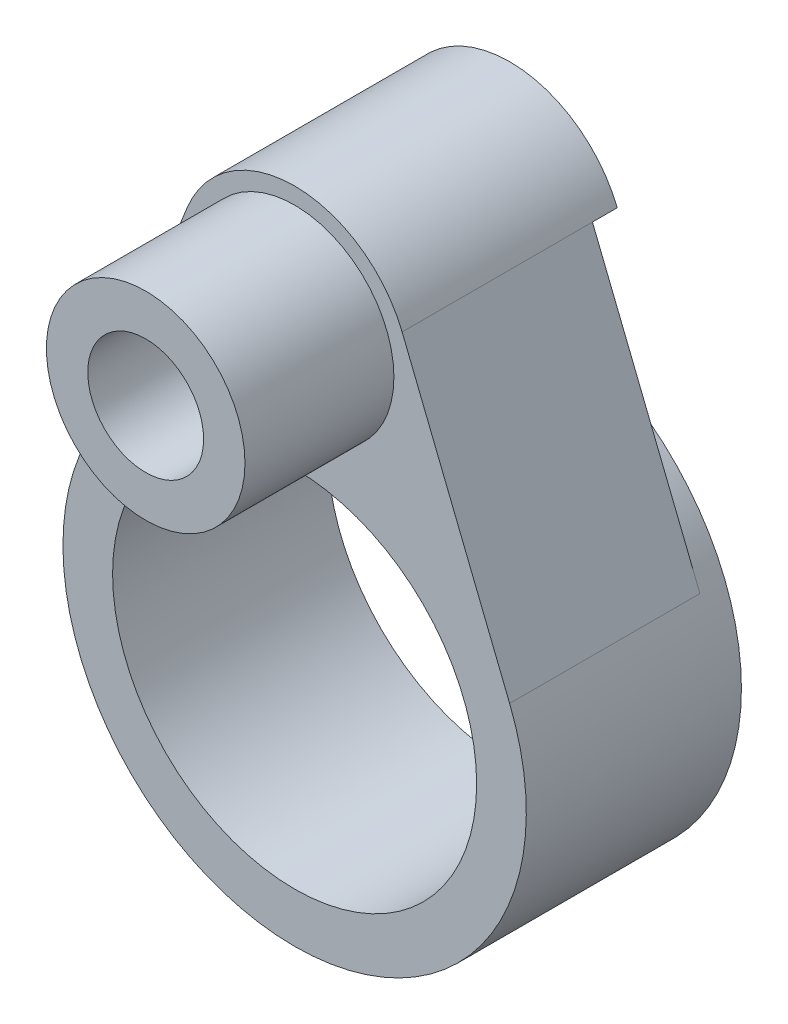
ISO-10303-21;
HEADER;
FILE_DESCRIPTION(('STEP AP214'),'2;1');
FILE_NAME('part.step','',(''),(''),'','','');
FILE_SCHEMA(('AUTOMOTIVE_DESIGN { 1 0 10303 214 1 1 1 1 }'));
ENDSEC;
DATA;
#1=APPLICATION_CONTEXT('core data for automotive mechanical design processes');
#2=APPLICATION_PROTOCOL_DEFINITION('international standard','automotive_design',2000,#1);
#3=PRODUCT_CONTEXT('',#1,'mechanical');
#4=PRODUCT('Part','Part','',(#3));
#5=PRODUCT_RELATED_PRODUCT_CATEGORY('part','',(#4));
#6=PRODUCT_DEFINITION_FORMATION('','',#4);
#7=PRODUCT_DEFINITION_CONTEXT('part definition',#1,'design');
#8=PRODUCT_DEFINITION('design','',#6,#7);
#9=PRODUCT_DEFINITION_SHAPE('','',#8);
#10=(LENGTH_UNIT() NAMED_UNIT(*) SI_UNIT(.MILLI.,.METRE.));
#11=(NAMED_UNIT(*) PLANE_ANGLE_UNIT() SI_UNIT($,.RADIAN.));
#12=(NAMED_UNIT(*) SI_UNIT($,.STERADIAN.) SOLID_ANGLE_UNIT());
#13=UNCERTAINTY_MEASURE_WITH_UNIT(LENGTH_MEASURE(1.E-05),#10,'distance_accuracy_value','');
#14=(GEOMETRIC_REPRESENTATION_CONTEXT(3) GLOBAL_UNCERTAINTY_ASSIGNED_CONTEXT((#13)) GLOBAL_UNIT_ASSIGNED_CONTEXT((#10,
#11,#12)) REPRESENTATION_CONTEXT('',''));
#15=CARTESIAN_POINT('',(0.,0.,0.));
#16=DIRECTION('',(0.,0.,1.));
#17=DIRECTION('',(1.,0.,0.));
#18=AXIS2_PLACEMENT_3D('',#15,#16,#17);
#19=CARTESIAN_POINT('',(0.,0.,0.));
#20=DIRECTION('',(0.,0.,1.));
#21=DIRECTION('',(1.,0.,0.));
#22=AXIS2_PLACEMENT_3D('',#19,#20,#21);
#23=PLANE('',#22);
#24=CARTESIAN_POINT('',(0.,18.8,0.));
#25=DIRECTION('',(0.,0.,1.));
#26=DIRECTION('',(1.,0.,0.));
#27=AXIS2_PLACEMENT_3D('',#24,#25,#26);
#28=CIRCLE('',#27,7.);
#29=CARTESIAN_POINT('',(6.4966735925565,21.4063829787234,0.));
#30=VERTEX_POINT('',#29);
#31=CARTESIAN_POINT('',(-6.4966735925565,21.4063829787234,0.));
#32=VERTEX_POINT('',#31);
#33=EDGE_CURVE('E108',#30,#32,#28,.T.);
#34=ORIENTED_EDGE('',*,*,#33,.F.);
#35=DIRECTION('',(1.,0.,0.));
#36=VECTOR('',#35,1.);
#37=CARTESIAN_POINT('',(6.4966735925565,21.4063829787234,0.));
#38=LINE('',#37,#36);
#39=CARTESIAN_POINT('',(2.33597255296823,21.4063829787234,0.));
#40=VERTEX_POINT('',#39);
#41=EDGE_CURVE('E90',#40,#30,#38,.T.);
#42=ORIENTED_EDGE('',*,*,#41,.F.);
#43=CARTESIAN_POINT('',(0.,18.8,0.));
#44=DIRECTION('',(0.,0.,1.));
#45=DIRECTION('',(1.,0.,0.));
#46=AXIS2_PLACEMENT_3D('',#43,#44,#45);
#47=CIRCLE('',#46,3.5);
#48=CARTESIAN_POINT('',(-2.33597255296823,21.4063829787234,0.));
#49=VERTEX_POINT('',#48);
#50=EDGE_CURVE('E168',#40,#49,#47,.T.);
#51=ORIENTED_EDGE('',*,*,#50,.T.);
#52=EDGE_CURVE('E101',#32,#49,#38,.T.);
#53=ORIENTED_EDGE('',*,*,#52,.F.);
#54=EDGE_LOOP('',(#34,#42,#51,#53));
#55=FACE_BOUND('',#54,.T.);
#56=ADVANCED_FACE('F31',(#55),#23,.F.);
#57=CARTESIAN_POINT('',(12.993347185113,5.21276595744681,13.));
#58=DIRECTION('',(-0.928096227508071,-0.372340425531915,0.));
#59=DIRECTION('',(0.372340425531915,-0.928096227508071,0.));
#60=AXIS2_PLACEMENT_3D('',#57,#58,#59);
#61=PLANE('',#60);
#62=DIRECTION('',(0.372340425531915,-0.928096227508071,0.));
#63=VECTOR('',#62,1.);
#64=CARTESIAN_POINT('',(12.993347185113,5.21276595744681,1.5));
#65=LINE('',#64,#63);
#66=CARTESIAN_POINT('',(6.4966735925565,21.4063829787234,1.5));
#67=VERTEX_POINT('',#66);
#68=CARTESIAN_POINT('',(12.993347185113,5.21276595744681,1.5));
#69=VERTEX_POINT('',#68);
#70=EDGE_CURVE('E152',#67,#69,#65,.T.);
#71=ORIENTED_EDGE('',*,*,#70,.F.);
#72=DIRECTION('',(0.,0.,-1.));
#73=VECTOR('',#72,1.);
#74=CARTESIAN_POINT('',(6.4966735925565,21.4063829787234,13.));
#75=LINE('',#74,#73);
#76=CARTESIAN_POINT('',(6.4966735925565,21.4063829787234,13.));
#77=VERTEX_POINT('',#76);
#78=EDGE_CURVE('E111',#77,#67,#75,.T.);
#79=ORIENTED_EDGE('',*,*,#78,.F.);
#80=DIRECTION('',(-0.372340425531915,0.928096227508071,0.));
#81=VECTOR('',#80,1.);
#82=CARTESIAN_POINT('',(12.993347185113,5.21276595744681,13.));
#83=LINE('',#82,#81);
#84=CARTESIAN_POINT('',(12.993347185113,5.21276595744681,13.));
#85=VERTEX_POINT('',#84);
#86=EDGE_CURVE('E119',#85,#77,#83,.T.);
#87=ORIENTED_EDGE('',*,*,#86,.F.);
#88=DIRECTION('',(0.,0.,-1.));
#89=VECTOR('',#88,1.);
#90=CARTESIAN_POINT('',(12.993347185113,5.21276595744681,13.));
#91=LINE('',#90,#89);
#92=EDGE_CURVE('E137',#85,#69,#91,.T.);
#93=ORIENTED_EDGE('',*,*,#92,.T.);
#94=EDGE_LOOP('',(#71,#79,#87,#93));
#95=FACE_BOUND('',#94,.T.);
#96=ADVANCED_FACE('F201',(#95),#61,.F.);
#97=CARTESIAN_POINT('',(-12.993347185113,5.21276595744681,13.));
#98=DIRECTION('',(0.928096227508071,-0.372340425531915,0.));
#99=DIRECTION('',(0.372340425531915,0.928096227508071,0.));
#100=AXIS2_PLACEMENT_3D('',#97,#98,#99);
#101=PLANE('',#100);
#102=DIRECTION('',(0.372340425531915,0.928096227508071,0.));
#103=VECTOR('',#102,1.);
#104=CARTESIAN_POINT('',(-6.4966735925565,21.4063829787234,1.5));
#105=LINE('',#104,#103);
#106=CARTESIAN_POINT('',(-12.993347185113,5.21276595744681,1.5));
#107=VERTEX_POINT('',#106);
#108=CARTESIAN_POINT('',(-6.4966735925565,21.4063829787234,1.5));
#109=VERTEX_POINT('',#108);
#110=EDGE_CURVE('E113',#107,#109,#105,.T.);
#111=ORIENTED_EDGE('',*,*,#110,.F.);
#112=DIRECTION('',(0.,0.,-1.));
#113=VECTOR('',#112,1.);
#114=CARTESIAN_POINT('',(-12.993347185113,5.21276595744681,13.));
#115=LINE('',#114,#113);
#116=CARTESIAN_POINT('',(-12.993347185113,5.21276595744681,13.));
#117=VERTEX_POINT('',#116);
#118=EDGE_CURVE('E130',#117,#107,#115,.T.);
#119=ORIENTED_EDGE('',*,*,#118,.F.);
#120=DIRECTION('',(-0.372340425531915,-0.928096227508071,0.));
#121=VECTOR('',#120,1.);
#122=CARTESIAN_POINT('',(-12.993347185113,5.21276595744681,13.));
#123=LINE('',#122,#121);
#124=CARTESIAN_POINT('',(-6.4966735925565,21.4063829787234,13.));
#125=VERTEX_POINT('',#124);
#126=EDGE_CURVE('E54',#125,#117,#123,.T.);
#127=ORIENTED_EDGE('',*,*,#126,.F.);
#128=DIRECTION('',(0.,0.,-1.));
#129=VECTOR('',#128,1.);
#130=CARTESIAN_POINT('',(-6.4966735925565,21.4063829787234,13.));
#131=LINE('',#130,#129);
#132=EDGE_CURVE('E133',#125,#109,#131,.T.);
#133=ORIENTED_EDGE('',*,*,#132,.T.);
#134=EDGE_LOOP('',(#111,#119,#127,#133));
#135=FACE_BOUND('',#134,.T.);
#136=ADVANCED_FACE('F182',(#135),#101,.F.);
#137=CARTESIAN_POINT('',(0.,0.,13.));
#138=DIRECTION('',(0.,0.,1.));
#139=DIRECTION('',(1.,0.,0.));
#140=AXIS2_PLACEMENT_3D('',#137,#138,#139);
#141=PLANE('',#140);
#142=CARTESIAN_POINT('',(0.,0.,13.));
#143=DIRECTION('',(0.,0.,1.));
#144=DIRECTION('',(1.,0.,0.));
#145=AXIS2_PLACEMENT_3D('',#142,#143,#144);
#146=CIRCLE('',#145,14.);
#147=EDGE_CURVE('E116',#117,#85,#146,.T.);
#148=ORIENTED_EDGE('',*,*,#147,.T.);
#149=ORIENTED_EDGE('',*,*,#86,.T.);
#150=CARTESIAN_POINT('',(0.,18.8,13.));
#151=DIRECTION('',(0.,0.,1.));
#152=DIRECTION('',(1.,0.,0.));
#153=AXIS2_PLACEMENT_3D('',#150,#151,#152);
#154=CIRCLE('',#153,7.);
#155=EDGE_CURVE('E127',#77,#125,#154,.T.);
#156=ORIENTED_EDGE('',*,*,#155,.T.);
#157=ORIENTED_EDGE('',*,*,#126,.T.);
#158=EDGE_LOOP('',(#148,#149,#156,#157));
#159=FACE_BOUND('',#158,.T.);
#160=CARTESIAN_POINT('',(0.,0.,13.));
#161=DIRECTION('',(0.,0.,1.));
#162=DIRECTION('',(1.,0.,0.));
#163=AXIS2_PLACEMENT_3D('',#160,#161,#162);
#164=CIRCLE('',#163,11.);
#165=CARTESIAN_POINT('',(-11.,0.,13.));
#166=VERTEX_POINT('',#165);
#167=EDGE_CURVE('E122',#166,#166,#164,.T.);
#168=ORIENTED_EDGE('',*,*,#167,.F.);
#169=EDGE_LOOP('',(#168));
#170=FACE_BOUND('',#169,.T.);
#171=CARTESIAN_POINT('',(0.,18.8,13.));
#172=DIRECTION('',(0.,0.,1.));
#173=DIRECTION('',(1.,0.,0.));
#174=AXIS2_PLACEMENT_3D('',#171,#172,#173);
#175=CIRCLE('',#174,6.);
#176=CARTESIAN_POINT('',(6.,18.8,13.));
#177=VERTEX_POINT('',#176);
#178=EDGE_CURVE('E162',#177,#177,#175,.T.);
#179=ORIENTED_EDGE('',*,*,#178,.F.);
#180=EDGE_LOOP('',(#179));
#181=FACE_BOUND('',#180,.T.);
#182=ADVANCED_FACE('F178',(#159,#170,#181),#141,.T.);
#183=CARTESIAN_POINT('',(0.,0.,0.));
#184=DIRECTION('',(0.,0.,1.));
#185=DIRECTION('',(1.,0.,0.));
#186=AXIS2_PLACEMENT_3D('',#183,#184,#185);
#187=CIRCLE('',#186,11.);
#188=CARTESIAN_POINT('',(-11.,0.,0.));
#189=VERTEX_POINT('',#188);
#190=EDGE_CURVE('E170',#189,#189,#187,.T.);
#191=ORIENTED_EDGE('',*,*,#190,.T.);
#192=EDGE_LOOP('',(#191));
#193=FACE_BOUND('',#192,.T.);
#194=CARTESIAN_POINT('',(0.,0.,0.));
#195=DIRECTION('',(0.,0.,1.));
#196=DIRECTION('',(1.,0.,0.));
#197=AXIS2_PLACEMENT_3D('',#194,#195,#196);
#198=CIRCLE('',#197,14.);
#199=CARTESIAN_POINT('',(14.,0.,0.));
#200=VERTEX_POINT('',#199);
#201=EDGE_CURVE('E117',#200,#200,#198,.T.);
#202=ORIENTED_EDGE('',*,*,#201,.F.);
#203=EDGE_LOOP('',(#202));
#204=FACE_BOUND('',#203,.T.);
#205=ADVANCED_FACE('F181',(#193,#204),#23,.F.);
#206=CARTESIAN_POINT('',(0.,0.,13.));
#207=DIRECTION('',(0.,0.,-1.));
#208=DIRECTION('',(-1.,0.,0.));
#209=AXIS2_PLACEMENT_3D('',#206,#207,#208);
#210=CYLINDRICAL_SURFACE('',#209,14.);
#211=ORIENTED_EDGE('',*,*,#201,.T.);
#212=EDGE_LOOP('',(#211));
#213=FACE_BOUND('',#212,.T.);
#214=CARTESIAN_POINT('',(0.,0.,1.5));
#215=DIRECTION('',(0.,0.,1.));
#216=DIRECTION('',(-1.,0.,0.));
#217=AXIS2_PLACEMENT_3D('',#214,#215,#216);
#218=CIRCLE('',#217,14.);
#219=EDGE_CURVE('E155',#69,#107,#218,.T.);
#220=ORIENTED_EDGE('',*,*,#219,.F.);
#221=ORIENTED_EDGE('',*,*,#92,.F.);
#222=ORIENTED_EDGE('',*,*,#147,.F.);
#223=ORIENTED_EDGE('',*,*,#118,.T.);
#224=EDGE_LOOP('',(#220,#221,#222,#223));
#225=FACE_BOUND('',#224,.T.);
#226=ADVANCED_FACE('F33',(#213,#225),#210,.T.);
#227=CARTESIAN_POINT('',(0.,18.8,13.));
#228=DIRECTION('',(0.,0.,-1.));
#229=DIRECTION('',(-1.,0.,0.));
#230=AXIS2_PLACEMENT_3D('',#227,#228,#229);
#231=CYLINDRICAL_SURFACE('',#230,7.);
#232=ORIENTED_EDGE('',*,*,#33,.T.);
#233=DIRECTION('',(0.,0.,-1.));
#234=VECTOR('',#233,1.);
#235=CARTESIAN_POINT('',(-6.4966735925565,21.4063829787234,1.5));
#236=LINE('',#235,#234);
#237=EDGE_CURVE('E112',#109,#32,#236,.T.);
#238=ORIENTED_EDGE('',*,*,#237,.F.);
#239=ORIENTED_EDGE('',*,*,#132,.F.);
#240=ORIENTED_EDGE('',*,*,#155,.F.);
#241=ORIENTED_EDGE('',*,*,#78,.T.);
#242=DIRECTION('',(0.,0.,-1.));
#243=VECTOR('',#242,1.);
#244=CARTESIAN_POINT('',(6.4966735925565,21.4063829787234,1.5));
#245=LINE('',#244,#243);
#246=EDGE_CURVE('E94',#67,#30,#245,.T.);
#247=ORIENTED_EDGE('',*,*,#246,.T.);
#248=EDGE_LOOP('',(#232,#238,#239,#240,#241,#247));
#249=FACE_BOUND('',#248,.T.);
#250=ADVANCED_FACE('F106',(#249),#231,.T.);
#251=CARTESIAN_POINT('',(0.,0.,13.));
#252=DIRECTION('',(0.,0.,-1.));
#253=DIRECTION('',(-1.,0.,0.));
#254=AXIS2_PLACEMENT_3D('',#251,#252,#253);
#255=CYLINDRICAL_SURFACE('',#254,11.);
#256=CARTESIAN_POINT('',(-11.,0.,13.));
#257=CARTESIAN_POINT('',(-11.,0.,12.8645833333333));
#258=CARTESIAN_POINT('',(-11.,0.,12.7291666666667));
#259=CARTESIAN_POINT('',(-11.,0.,12.4583333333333));
#260=CARTESIAN_POINT('',(-11.,0.,12.3229166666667));
#261=CARTESIAN_POINT('',(-11.,0.,12.0520833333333));
#262=CARTESIAN_POINT('',(-11.,0.,11.9166666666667));
#263=CARTESIAN_POINT('',(-11.,0.,11.6458333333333));
#264=CARTESIAN_POINT('',(-11.,0.,11.5104166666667));
#265=CARTESIAN_POINT('',(-11.,0.,11.2395833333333));
#266=CARTESIAN_POINT('',(-11.,0.,11.1041666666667));
#267=CARTESIAN_POINT('',(-11.,0.,10.8333333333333));
#268=CARTESIAN_POINT('',(-11.,0.,10.6979166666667));
#269=CARTESIAN_POINT('',(-11.,0.,10.4270833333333));
#270=CARTESIAN_POINT('',(-11.,0.,10.2916666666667));
#271=CARTESIAN_POINT('',(-11.,0.,10.0208333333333));
#272=CARTESIAN_POINT('',(-11.,0.,9.88541666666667));
#273=CARTESIAN_POINT('',(-11.,0.,9.61458333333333));
#274=CARTESIAN_POINT('',(-11.,0.,9.47916666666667));
#275=CARTESIAN_POINT('',(-11.,0.,9.20833333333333));
#276=CARTESIAN_POINT('',(-11.,0.,9.07291666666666));
#277=CARTESIAN_POINT('',(-11.,0.,8.80208333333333));
#278=CARTESIAN_POINT('',(-11.,0.,8.66666666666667));
#279=CARTESIAN_POINT('',(-11.,0.,8.39583333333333));
#280=CARTESIAN_POINT('',(-11.,0.,8.26041666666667));
#281=CARTESIAN_POINT('',(-11.,0.,7.98958333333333));
#282=CARTESIAN_POINT('',(-11.,0.,7.85416666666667));
#283=CARTESIAN_POINT('',(-11.,0.,7.58333333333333));
#284=CARTESIAN_POINT('',(-11.,0.,7.44791666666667));
#285=CARTESIAN_POINT('',(-11.,0.,7.17708333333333));
#286=CARTESIAN_POINT('',(-11.,0.,7.04166666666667));
#287=CARTESIAN_POINT('',(-11.,0.,6.77083333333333));
#288=CARTESIAN_POINT('',(-11.,0.,6.63541666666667));
#289=CARTESIAN_POINT('',(-11.,0.,6.36458333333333));
#290=CARTESIAN_POINT('',(-11.,0.,6.22916666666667));
#291=CARTESIAN_POINT('',(-11.,0.,5.95833333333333));
#292=CARTESIAN_POINT('',(-11.,0.,5.82291666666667));
#293=CARTESIAN_POINT('',(-11.,0.,5.55208333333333));
#294=CARTESIAN_POINT('',(-11.,0.,5.41666666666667));
#295=CARTESIAN_POINT('',(-11.,0.,5.14583333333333));
#296=CARTESIAN_POINT('',(-11.,0.,5.01041666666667));
#297=CARTESIAN_POINT('',(-11.,0.,4.73958333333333));
#298=CARTESIAN_POINT('',(-11.,0.,4.60416666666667));
#299=CARTESIAN_POINT('',(-11.,0.,4.33333333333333));
#300=CARTESIAN_POINT('',(-11.,0.,4.19791666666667));
#301=CARTESIAN_POINT('',(-11.,0.,3.92708333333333));
#302=CARTESIAN_POINT('',(-11.,0.,3.79166666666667));
#303=CARTESIAN_POINT('',(-11.,0.,3.52083333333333));
#304=CARTESIAN_POINT('',(-11.,0.,3.38541666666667));
#305=CARTESIAN_POINT('',(-11.,0.,3.11458333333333));
#306=CARTESIAN_POINT('',(-11.,0.,2.97916666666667));
#307=CARTESIAN_POINT('',(-11.,0.,2.70833333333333));
#308=CARTESIAN_POINT('',(-11.,0.,2.57291666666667));
#309=CARTESIAN_POINT('',(-11.,0.,2.30208333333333));
#310=CARTESIAN_POINT('',(-11.,0.,2.16666666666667));
#311=CARTESIAN_POINT('',(-11.,0.,1.89583333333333));
#312=CARTESIAN_POINT('',(-11.,0.,1.76041666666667));
#313=CARTESIAN_POINT('',(-11.,0.,1.48958333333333));
#314=CARTESIAN_POINT('',(-11.,0.,1.35416666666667));
#315=CARTESIAN_POINT('',(-11.,0.,1.08333333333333));
#316=CARTESIAN_POINT('',(-11.,0.,0.947916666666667));
#317=CARTESIAN_POINT('',(-11.,0.,0.677083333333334));
#318=CARTESIAN_POINT('',(-11.,0.,0.541666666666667));
#319=CARTESIAN_POINT('',(-11.,0.,0.270833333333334));
#320=CARTESIAN_POINT('',(-11.,0.,0.135416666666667));
#321=CARTESIAN_POINT('',(-11.,0.,0.));
#322=B_SPLINE_CURVE_WITH_KNOTS('',3,(#256,#257,#258,#259,#260,#261,#262,#263,#264,#265,#266,
#267,#268,#269,#270,#271,#272,#273,#274,#275,#276,#277,#278,#279,#280,#281,#282,#283,#284,#285,
#286,#287,#288,#289,#290,#291,#292,#293,#294,#295,#296,#297,#298,#299,#300,#301,#302,#303,#304,
#305,#306,#307,#308,#309,#310,#311,#312,#313,#314,#315,#316,#317,#318,#319,#320,#321),
.UNSPECIFIED.,.F.,.F.,(4,2,2,2,2,2,2,2,2,2,2,2,2,2,2,2,2,2,2,2,2,2,2,2,2,2,2,2,2,2,2,2,4),(0.,
0.40625,0.812500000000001,1.21875,1.625,2.03125,2.4375,2.84375,3.25,3.65625,4.0625,4.46875,
4.875,5.28125,5.6875,6.09375,6.5,6.90625,7.3125,7.71875,8.125,8.53125,8.9375,9.34375,9.75,
10.15625,10.5625,10.96875,11.375,11.78125,12.1875,12.59375,13.),.UNSPECIFIED.);
#323=EDGE_CURVE('BSEAM175',#166,#189,#322,.T.);
#324=ORIENTED_EDGE('',*,*,#167,.T.);
#325=ORIENTED_EDGE('',*,*,#190,.F.);
#326=ORIENTED_EDGE('',*,*,#323,.T.);
#327=ORIENTED_EDGE('',*,*,#323,.F.);
#328=EDGE_LOOP('',(#324,#326,#325,#327));
#329=FACE_BOUND('',#328,.T.);
#330=ADVANCED_FACE('F175',(#329),#255,.F.);
#331=CARTESIAN_POINT('',(0.,18.8,13.));
#332=DIRECTION('',(0.,0.,-1.));
#333=DIRECTION('',(-1.,0.,0.));
#334=AXIS2_PLACEMENT_3D('',#331,#332,#333);
#335=CYLINDRICAL_SURFACE('',#334,3.5);
#336=DIRECTION('',(0.,0.,-1.));
#337=VECTOR('',#336,1.);
#338=CARTESIAN_POINT('',(2.33597255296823,21.4063829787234,13.));
#339=LINE('',#338,#337);
#340=CARTESIAN_POINT('',(2.33597255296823,21.4063829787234,1.5));
#341=VERTEX_POINT('',#340);
#342=EDGE_CURVE('E11',#341,#40,#339,.T.);
#343=ORIENTED_EDGE('',*,*,#342,.F.);
#344=CARTESIAN_POINT('',(0.,18.8,1.5));
#345=DIRECTION('',(0.,0.,-1.));
#346=DIRECTION('',(-1.,0.,0.));
#347=AXIS2_PLACEMENT_3D('',#344,#345,#346);
#348=CIRCLE('',#347,3.5);
#349=CARTESIAN_POINT('',(-2.33597255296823,21.4063829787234,1.5));
#350=VERTEX_POINT('',#349);
#351=EDGE_CURVE('E140',#341,#350,#348,.T.);
#352=ORIENTED_EDGE('',*,*,#351,.T.);
#353=DIRECTION('',(0.,0.,-1.));
#354=VECTOR('',#353,1.);
#355=CARTESIAN_POINT('',(-2.33597255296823,21.4063829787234,13.));
#356=LINE('',#355,#354);
#357=EDGE_CURVE('E39',#49,#350,#356,.F.);
#358=ORIENTED_EDGE('',*,*,#357,.F.);
#359=ORIENTED_EDGE('',*,*,#50,.F.);
#360=EDGE_LOOP('',(#343,#352,#358,#359));
#361=FACE_BOUND('',#360,.T.);
#362=CARTESIAN_POINT('',(0.,18.8,22.));
#363=DIRECTION('',(0.,0.,1.));
#364=DIRECTION('',(1.,0.,0.));
#365=AXIS2_PLACEMENT_3D('',#362,#363,#364);
#366=CIRCLE('',#365,3.5);
#367=CARTESIAN_POINT('',(3.5,18.8,22.));
#368=VERTEX_POINT('',#367);
#369=EDGE_CURVE('E158',#368,#368,#366,.T.);
#370=ORIENTED_EDGE('',*,*,#369,.T.);
#371=EDGE_LOOP('',(#370));
#372=FACE_BOUND('',#371,.T.);
#373=ADVANCED_FACE('F146',(#361,#372),#335,.F.);
#374=CARTESIAN_POINT('',(0.,18.8,22.));
#375=DIRECTION('',(0.,0.,1.));
#376=DIRECTION('',(1.,0.,0.));
#377=AXIS2_PLACEMENT_3D('',#374,#375,#376);
#378=PLANE('',#377);
#379=CARTESIAN_POINT('',(0.,18.8,22.));
#380=DIRECTION('',(0.,0.,1.));
#381=DIRECTION('',(1.,0.,0.));
#382=AXIS2_PLACEMENT_3D('',#379,#380,#381);
#383=CIRCLE('',#382,6.);
#384=CARTESIAN_POINT('',(6.,18.8,22.));
#385=VERTEX_POINT('',#384);
#386=EDGE_CURVE('E165',#385,#385,#383,.T.);
#387=ORIENTED_EDGE('',*,*,#386,.T.);
#388=EDGE_LOOP('',(#387));
#389=FACE_BOUND('',#388,.T.);
#390=ORIENTED_EDGE('',*,*,#369,.F.);
#391=EDGE_LOOP('',(#390));
#392=FACE_BOUND('',#391,.T.);
#393=ADVANCED_FACE('F188',(#389,#392),#378,.T.);
#394=CARTESIAN_POINT('',(0.,18.8,22.));
#395=DIRECTION('',(0.,0.,-1.));
#396=DIRECTION('',(-1.,0.,0.));
#397=AXIS2_PLACEMENT_3D('',#394,#395,#396);
#398=CYLINDRICAL_SURFACE('',#397,6.);
#399=ORIENTED_EDGE('',*,*,#386,.F.);
#400=EDGE_LOOP('',(#399));
#401=FACE_BOUND('',#400,.T.);
#402=ORIENTED_EDGE('',*,*,#178,.T.);
#403=EDGE_LOOP('',(#402));
#404=FACE_BOUND('',#403,.T.);
#405=ADVANCED_FACE('F186',(#401,#404),#398,.T.);
#406=CARTESIAN_POINT('',(6.4966735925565,21.4063829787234,1.5));
#407=DIRECTION('',(0.,1.,0.));
#408=DIRECTION('',(0.,0.,1.));
#409=AXIS2_PLACEMENT_3D('',#406,#407,#408);
#410=PLANE('',#409);
#411=ORIENTED_EDGE('',*,*,#342,.T.);
#412=ORIENTED_EDGE('',*,*,#41,.T.);
#413=ORIENTED_EDGE('',*,*,#246,.F.);
#414=DIRECTION('',(1.,0.,0.));
#415=VECTOR('',#414,1.);
#416=CARTESIAN_POINT('',(6.4966735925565,21.4063829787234,1.5));
#417=LINE('',#416,#415);
#418=EDGE_CURVE('E150',#341,#67,#417,.T.);
#419=ORIENTED_EDGE('',*,*,#418,.F.);
#420=EDGE_LOOP('',(#411,#412,#413,#419));
#421=FACE_BOUND('',#420,.T.);
#422=ADVANCED_FACE('F92',(#421),#410,.F.);
#423=ORIENTED_EDGE('',*,*,#357,.T.);
#424=EDGE_CURVE('E46',#109,#350,#417,.T.);
#425=ORIENTED_EDGE('',*,*,#424,.F.);
#426=ORIENTED_EDGE('',*,*,#237,.T.);
#427=ORIENTED_EDGE('',*,*,#52,.T.);
#428=EDGE_LOOP('',(#423,#425,#426,#427));
#429=FACE_BOUND('',#428,.T.);
#430=ADVANCED_FACE('F144',(#429),#410,.F.);
#431=CARTESIAN_POINT('',(0.,0.,1.5));
#432=DIRECTION('',(0.,0.,-1.));
#433=DIRECTION('',(-1.,0.,0.));
#434=AXIS2_PLACEMENT_3D('',#431,#432,#433);
#435=PLANE('',#434);
#436=ORIENTED_EDGE('',*,*,#418,.T.);
#437=ORIENTED_EDGE('',*,*,#70,.T.);
#438=ORIENTED_EDGE('',*,*,#219,.T.);
#439=ORIENTED_EDGE('',*,*,#110,.T.);
#440=ORIENTED_EDGE('',*,*,#424,.T.);
#441=ORIENTED_EDGE('',*,*,#351,.F.);
#442=EDGE_LOOP('',(#436,#437,#438,#439,#440,#441));
#443=FACE_BOUND('',#442,.T.);
#444=ADVANCED_FACE('F148',(#443),#435,.T.);
#445=CLOSED_SHELL('',(#56,#96,#136,#182,#205,#226,#250,#330,#373,#393,#405,#422,#430,#444));
#446=MANIFOLD_SOLID_BREP('B2',#445);
#447=ADVANCED_BREP_SHAPE_REPRESENTATION('',(#18,#446),#14);
#448=SHAPE_DEFINITION_REPRESENTATION(#9,#447);
ENDSEC;
END-ISO-10303-21;
